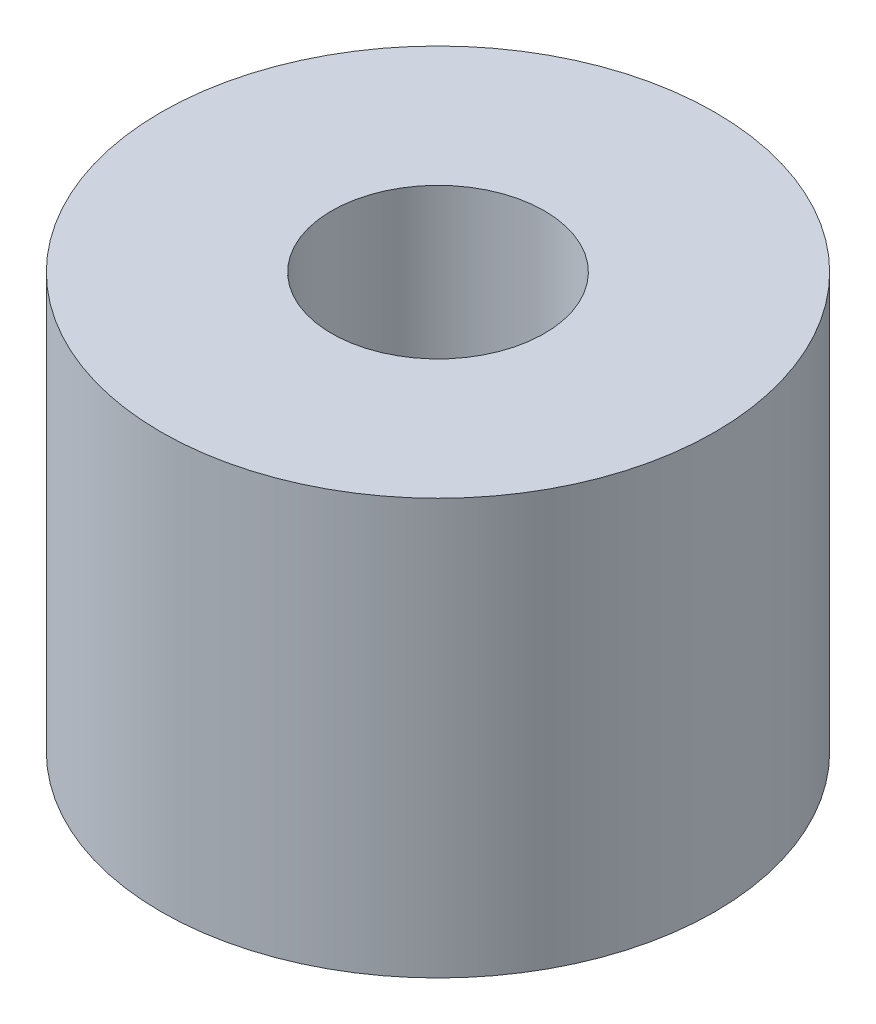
ISO-10303-21;
HEADER;
FILE_DESCRIPTION(('STEP AP214'),'2;1');
FILE_NAME('part.step','',(''),(''),'','','');
FILE_SCHEMA(('AUTOMOTIVE_DESIGN { 1 0 10303 214 1 1 1 1 }'));
ENDSEC;
DATA;
#1=APPLICATION_CONTEXT('core data for automotive mechanical design processes');
#2=APPLICATION_PROTOCOL_DEFINITION('international standard','automotive_design',2000,#1);
#3=PRODUCT_CONTEXT('',#1,'mechanical');
#4=PRODUCT('Part','Part','',(#3));
#5=PRODUCT_RELATED_PRODUCT_CATEGORY('part','',(#4));
#6=PRODUCT_DEFINITION_FORMATION('','',#4);
#7=PRODUCT_DEFINITION_CONTEXT('part definition',#1,'design');
#8=PRODUCT_DEFINITION('design','',#6,#7);
#9=PRODUCT_DEFINITION_SHAPE('','',#8);
#10=(LENGTH_UNIT() NAMED_UNIT(*) SI_UNIT(.MILLI.,.METRE.));
#11=(NAMED_UNIT(*) PLANE_ANGLE_UNIT() SI_UNIT($,.RADIAN.));
#12=(NAMED_UNIT(*) SI_UNIT($,.STERADIAN.) SOLID_ANGLE_UNIT());
#13=UNCERTAINTY_MEASURE_WITH_UNIT(LENGTH_MEASURE(1.E-05),#10,'distance_accuracy_value','');
#14=(GEOMETRIC_REPRESENTATION_CONTEXT(3) GLOBAL_UNCERTAINTY_ASSIGNED_CONTEXT((#13)) GLOBAL_UNIT_ASSIGNED_CONTEXT((#10,
#11,#12)) REPRESENTATION_CONTEXT('',''));
#15=CARTESIAN_POINT('',(0.,0.,0.));
#16=DIRECTION('',(0.,0.,1.));
#17=DIRECTION('',(1.,0.,0.));
#18=AXIS2_PLACEMENT_3D('',#15,#16,#17);
#19=CARTESIAN_POINT('',(0.,9.525,0.));
#20=DIRECTION('',(0.,1.,0.));
#21=DIRECTION('',(0.,0.,1.));
#22=AXIS2_PLACEMENT_3D('',#19,#20,#21);
#23=PLANE('',#22);
#24=CARTESIAN_POINT('',(0.,9.525,0.));
#25=DIRECTION('',(0.,1.,0.));
#26=DIRECTION('',(0.,0.,1.));
#27=AXIS2_PLACEMENT_3D('',#24,#25,#26);
#28=CIRCLE('',#27,6.35);
#29=CARTESIAN_POINT('',(0.,9.525,-6.35));
#30=VERTEX_POINT('',#29);
#31=EDGE_CURVE('E10',#30,#30,#28,.T.);
#32=ORIENTED_EDGE('',*,*,#31,.T.);
#33=EDGE_LOOP('',(#32));
#34=FACE_BOUND('',#33,.T.);
#35=CARTESIAN_POINT('',(0.,9.525,0.));
#36=DIRECTION('',(0.,1.,0.));
#37=DIRECTION('',(0.,0.,1.));
#38=AXIS2_PLACEMENT_3D('',#35,#36,#37);
#39=CIRCLE('',#38,2.4384);
#40=CARTESIAN_POINT('',(0.,9.525,-2.4384));
#41=VERTEX_POINT('',#40);
#42=EDGE_CURVE('E44',#41,#41,#39,.T.);
#43=ORIENTED_EDGE('',*,*,#42,.F.);
#44=EDGE_LOOP('',(#43));
#45=FACE_BOUND('',#44,.T.);
#46=ADVANCED_FACE('F33',(#34,#45),#23,.T.);
#47=CARTESIAN_POINT('',(0.,0.,0.));
#48=DIRECTION('',(0.,1.,0.));
#49=DIRECTION('',(0.,0.,1.));
#50=AXIS2_PLACEMENT_3D('',#47,#48,#49);
#51=PLANE('',#50);
#52=CARTESIAN_POINT('',(0.,0.,0.));
#53=DIRECTION('',(0.,1.,0.));
#54=DIRECTION('',(0.,0.,1.));
#55=AXIS2_PLACEMENT_3D('',#52,#53,#54);
#56=CIRCLE('',#55,6.35);
#57=CARTESIAN_POINT('',(0.,0.,-6.35));
#58=VERTEX_POINT('',#57);
#59=EDGE_CURVE('E37',#58,#58,#56,.T.);
#60=ORIENTED_EDGE('',*,*,#59,.F.);
#61=EDGE_LOOP('',(#60));
#62=FACE_BOUND('',#61,.T.);
#63=CARTESIAN_POINT('',(0.,0.,0.));
#64=DIRECTION('',(0.,1.,0.));
#65=DIRECTION('',(0.,0.,1.));
#66=AXIS2_PLACEMENT_3D('',#63,#64,#65);
#67=CIRCLE('',#66,2.4384);
#68=CARTESIAN_POINT('',(0.,0.,-2.4384));
#69=VERTEX_POINT('',#68);
#70=EDGE_CURVE('E46',#69,#69,#67,.T.);
#71=ORIENTED_EDGE('',*,*,#70,.T.);
#72=EDGE_LOOP('',(#71));
#73=FACE_BOUND('',#72,.T.);
#74=ADVANCED_FACE('F56',(#62,#73),#51,.F.);
#75=CARTESIAN_POINT('',(0.,9.525,0.));
#76=DIRECTION('',(0.,-1.,0.));
#77=DIRECTION('',(0.,0.,-1.));
#78=AXIS2_PLACEMENT_3D('',#75,#76,#77);
#79=CYLINDRICAL_SURFACE('',#78,6.35);
#80=CARTESIAN_POINT('',(0.,9.525,-6.35));
#81=CARTESIAN_POINT('',(0.,9.42578125,-6.35));
#82=CARTESIAN_POINT('',(0.,9.3265625,-6.35));
#83=CARTESIAN_POINT('',(0.,9.128125,-6.35));
#84=CARTESIAN_POINT('',(0.,9.02890625,-6.35));
#85=CARTESIAN_POINT('',(0.,8.83046875,-6.35));
#86=CARTESIAN_POINT('',(0.,8.73125,-6.35));
#87=CARTESIAN_POINT('',(0.,8.5328125,-6.35));
#88=CARTESIAN_POINT('',(0.,8.43359375,-6.35));
#89=CARTESIAN_POINT('',(0.,8.23515625,-6.35));
#90=CARTESIAN_POINT('',(0.,8.1359375,-6.35));
#91=CARTESIAN_POINT('',(0.,7.9375,-6.35));
#92=CARTESIAN_POINT('',(0.,7.83828125,-6.35));
#93=CARTESIAN_POINT('',(0.,7.63984375,-6.35));
#94=CARTESIAN_POINT('',(0.,7.540625,-6.35));
#95=CARTESIAN_POINT('',(0.,7.3421875,-6.35));
#96=CARTESIAN_POINT('',(0.,7.24296875,-6.35));
#97=CARTESIAN_POINT('',(0.,7.04453125,-6.35));
#98=CARTESIAN_POINT('',(0.,6.9453125,-6.35));
#99=CARTESIAN_POINT('',(0.,6.746875,-6.35));
#100=CARTESIAN_POINT('',(0.,6.64765625,-6.35));
#101=CARTESIAN_POINT('',(0.,6.44921875,-6.35));
#102=CARTESIAN_POINT('',(0.,6.35,-6.35));
#103=CARTESIAN_POINT('',(0.,6.1515625,-6.35));
#104=CARTESIAN_POINT('',(0.,6.05234375,-6.35));
#105=CARTESIAN_POINT('',(0.,5.85390625,-6.35));
#106=CARTESIAN_POINT('',(0.,5.7546875,-6.35));
#107=CARTESIAN_POINT('',(0.,5.55625,-6.35));
#108=CARTESIAN_POINT('',(0.,5.45703125,-6.35));
#109=CARTESIAN_POINT('',(0.,5.25859375,-6.35));
#110=CARTESIAN_POINT('',(0.,5.159375,-6.35));
#111=CARTESIAN_POINT('',(0.,4.9609375,-6.35));
#112=CARTESIAN_POINT('',(0.,4.86171875,-6.35));
#113=CARTESIAN_POINT('',(0.,4.66328125,-6.35));
#114=CARTESIAN_POINT('',(0.,4.5640625,-6.35));
#115=CARTESIAN_POINT('',(0.,4.365625,-6.35));
#116=CARTESIAN_POINT('',(0.,4.26640625,-6.35));
#117=CARTESIAN_POINT('',(0.,4.06796875,-6.35));
#118=CARTESIAN_POINT('',(0.,3.96875,-6.35));
#119=CARTESIAN_POINT('',(0.,3.7703125,-6.35));
#120=CARTESIAN_POINT('',(0.,3.67109375,-6.35));
#121=CARTESIAN_POINT('',(0.,3.47265625,-6.35));
#122=CARTESIAN_POINT('',(0.,3.3734375,-6.35));
#123=CARTESIAN_POINT('',(0.,3.175,-6.35));
#124=CARTESIAN_POINT('',(0.,3.07578125,-6.35));
#125=CARTESIAN_POINT('',(0.,2.87734375,-6.35));
#126=CARTESIAN_POINT('',(0.,2.778125,-6.35));
#127=CARTESIAN_POINT('',(0.,2.5796875,-6.35));
#128=CARTESIAN_POINT('',(0.,2.48046875,-6.35));
#129=CARTESIAN_POINT('',(0.,2.28203125,-6.35));
#130=CARTESIAN_POINT('',(0.,2.1828125,-6.35));
#131=CARTESIAN_POINT('',(0.,1.984375,-6.35));
#132=CARTESIAN_POINT('',(0.,1.88515625,-6.35));
#133=CARTESIAN_POINT('',(0.,1.68671875,-6.35));
#134=CARTESIAN_POINT('',(0.,1.5875,-6.35));
#135=CARTESIAN_POINT('',(0.,1.3890625,-6.35));
#136=CARTESIAN_POINT('',(0.,1.28984375,-6.35));
#137=CARTESIAN_POINT('',(0.,1.09140625,-6.35));
#138=CARTESIAN_POINT('',(0.,0.992187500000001,-6.35));
#139=CARTESIAN_POINT('',(0.,0.793750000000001,-6.35));
#140=CARTESIAN_POINT('',(0.,0.69453125,-6.35));
#141=CARTESIAN_POINT('',(0.,0.49609375,-6.35));
#142=CARTESIAN_POINT('',(0.,0.396875,-6.35));
#143=CARTESIAN_POINT('',(0.,0.1984375,-6.35));
#144=CARTESIAN_POINT('',(0.,0.0992187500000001,-6.35));
#145=CARTESIAN_POINT('',(0.,0.,-6.35));
#146=B_SPLINE_CURVE_WITH_KNOTS('',3,(#80,#81,#82,#83,#84,#85,#86,#87,#88,#89,#90,#91,#92,#93,
#94,#95,#96,#97,#98,#99,#100,#101,#102,#103,#104,#105,#106,#107,#108,#109,#110,#111,#112,#113,
#114,#115,#116,#117,#118,#119,#120,#121,#122,#123,#124,#125,#126,#127,#128,#129,#130,#131,#132,
#133,#134,#135,#136,#137,#138,#139,#140,#141,#142,#143,#144,#145),.UNSPECIFIED.,.F.,.F.,(4,2,2,
2,2,2,2,2,2,2,2,2,2,2,2,2,2,2,2,2,2,2,2,2,2,2,2,2,2,2,2,2,4),(0.,0.297656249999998,
0.595312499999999,0.892968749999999,1.190625,1.48828125,1.7859375,2.08359375,2.38125,2.67890625,
2.9765625,3.27421875,3.571875,3.86953125,4.1671875,4.46484375,4.7625,5.06015625,5.3578125,
5.65546875,5.953125,6.25078125,6.5484375,6.84609375,7.14375,7.44140625,7.7390625,8.03671875,
8.334375,8.63203125,8.9296875,9.22734375,9.525),.UNSPECIFIED.);
#147=EDGE_CURVE('BSEAM35',#30,#58,#146,.T.);
#148=ORIENTED_EDGE('',*,*,#31,.F.);
#149=ORIENTED_EDGE('',*,*,#59,.T.);
#150=ORIENTED_EDGE('',*,*,#147,.T.);
#151=ORIENTED_EDGE('',*,*,#147,.F.);
#152=EDGE_LOOP('',(#148,#150,#149,#151));
#153=FACE_BOUND('',#152,.T.);
#154=ADVANCED_FACE('F35',(#153),#79,.T.);
#155=CARTESIAN_POINT('',(0.,9.525,0.));
#156=DIRECTION('',(0.,-1.,0.));
#157=DIRECTION('',(0.,0.,-1.));
#158=AXIS2_PLACEMENT_3D('',#155,#156,#157);
#159=CYLINDRICAL_SURFACE('',#158,2.4384);
#160=CARTESIAN_POINT('',(0.,9.525,-2.4384));
#161=CARTESIAN_POINT('',(0.,9.42578125,-2.4384));
#162=CARTESIAN_POINT('',(0.,9.3265625,-2.4384));
#163=CARTESIAN_POINT('',(0.,9.128125,-2.4384));
#164=CARTESIAN_POINT('',(0.,9.02890625,-2.4384));
#165=CARTESIAN_POINT('',(0.,8.83046875,-2.4384));
#166=CARTESIAN_POINT('',(0.,8.73125,-2.4384));
#167=CARTESIAN_POINT('',(0.,8.5328125,-2.4384));
#168=CARTESIAN_POINT('',(0.,8.43359375,-2.4384));
#169=CARTESIAN_POINT('',(0.,8.23515625,-2.4384));
#170=CARTESIAN_POINT('',(0.,8.1359375,-2.4384));
#171=CARTESIAN_POINT('',(0.,7.9375,-2.4384));
#172=CARTESIAN_POINT('',(0.,7.83828125,-2.4384));
#173=CARTESIAN_POINT('',(0.,7.63984375,-2.4384));
#174=CARTESIAN_POINT('',(0.,7.540625,-2.4384));
#175=CARTESIAN_POINT('',(0.,7.3421875,-2.4384));
#176=CARTESIAN_POINT('',(0.,7.24296875,-2.4384));
#177=CARTESIAN_POINT('',(0.,7.04453125,-2.4384));
#178=CARTESIAN_POINT('',(0.,6.9453125,-2.4384));
#179=CARTESIAN_POINT('',(0.,6.746875,-2.4384));
#180=CARTESIAN_POINT('',(0.,6.64765625,-2.4384));
#181=CARTESIAN_POINT('',(0.,6.44921875,-2.4384));
#182=CARTESIAN_POINT('',(0.,6.35,-2.4384));
#183=CARTESIAN_POINT('',(0.,6.1515625,-2.4384));
#184=CARTESIAN_POINT('',(0.,6.05234375,-2.4384));
#185=CARTESIAN_POINT('',(0.,5.85390625,-2.4384));
#186=CARTESIAN_POINT('',(0.,5.7546875,-2.4384));
#187=CARTESIAN_POINT('',(0.,5.55625,-2.4384));
#188=CARTESIAN_POINT('',(0.,5.45703125,-2.4384));
#189=CARTESIAN_POINT('',(0.,5.25859375,-2.4384));
#190=CARTESIAN_POINT('',(0.,5.159375,-2.4384));
#191=CARTESIAN_POINT('',(0.,4.9609375,-2.4384));
#192=CARTESIAN_POINT('',(0.,4.86171875,-2.4384));
#193=CARTESIAN_POINT('',(0.,4.66328125,-2.4384));
#194=CARTESIAN_POINT('',(0.,4.5640625,-2.4384));
#195=CARTESIAN_POINT('',(0.,4.365625,-2.4384));
#196=CARTESIAN_POINT('',(0.,4.26640625,-2.4384));
#197=CARTESIAN_POINT('',(0.,4.06796875,-2.4384));
#198=CARTESIAN_POINT('',(0.,3.96875,-2.4384));
#199=CARTESIAN_POINT('',(0.,3.7703125,-2.4384));
#200=CARTESIAN_POINT('',(0.,3.67109375,-2.4384));
#201=CARTESIAN_POINT('',(0.,3.47265625,-2.4384));
#202=CARTESIAN_POINT('',(0.,3.3734375,-2.4384));
#203=CARTESIAN_POINT('',(0.,3.175,-2.4384));
#204=CARTESIAN_POINT('',(0.,3.07578125,-2.4384));
#205=CARTESIAN_POINT('',(0.,2.87734375,-2.4384));
#206=CARTESIAN_POINT('',(0.,2.778125,-2.4384));
#207=CARTESIAN_POINT('',(0.,2.5796875,-2.4384));
#208=CARTESIAN_POINT('',(0.,2.48046875,-2.4384));
#209=CARTESIAN_POINT('',(0.,2.28203125,-2.4384));
#210=CARTESIAN_POINT('',(0.,2.1828125,-2.4384));
#211=CARTESIAN_POINT('',(0.,1.984375,-2.4384));
#212=CARTESIAN_POINT('',(0.,1.88515625,-2.4384));
#213=CARTESIAN_POINT('',(0.,1.68671875,-2.4384));
#214=CARTESIAN_POINT('',(0.,1.5875,-2.4384));
#215=CARTESIAN_POINT('',(0.,1.3890625,-2.4384));
#216=CARTESIAN_POINT('',(0.,1.28984375,-2.4384));
#217=CARTESIAN_POINT('',(0.,1.09140625,-2.4384));
#218=CARTESIAN_POINT('',(0.,0.992187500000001,-2.4384));
#219=CARTESIAN_POINT('',(0.,0.793750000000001,-2.4384));
#220=CARTESIAN_POINT('',(0.,0.69453125,-2.4384));
#221=CARTESIAN_POINT('',(0.,0.49609375,-2.4384));
#222=CARTESIAN_POINT('',(0.,0.396875,-2.4384));
#223=CARTESIAN_POINT('',(0.,0.1984375,-2.4384));
#224=CARTESIAN_POINT('',(0.,0.0992187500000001,-2.4384));
#225=CARTESIAN_POINT('',(0.,0.,-2.4384));
#226=B_SPLINE_CURVE_WITH_KNOTS('',3,(#160,#161,#162,#163,#164,#165,#166,#167,#168,#169,#170,
#171,#172,#173,#174,#175,#176,#177,#178,#179,#180,#181,#182,#183,#184,#185,#186,#187,#188,#189,
#190,#191,#192,#193,#194,#195,#196,#197,#198,#199,#200,#201,#202,#203,#204,#205,#206,#207,#208,
#209,#210,#211,#212,#213,#214,#215,#216,#217,#218,#219,#220,#221,#222,#223,#224,#225),
.UNSPECIFIED.,.F.,.F.,(4,2,2,2,2,2,2,2,2,2,2,2,2,2,2,2,2,2,2,2,2,2,2,2,2,2,2,2,2,2,2,2,4),(0.,
0.29765625,0.5953125,0.892968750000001,1.190625,1.48828125,1.7859375,2.08359375,2.38125,
2.67890625,2.9765625,3.27421875,3.571875,3.86953125,4.1671875,4.46484375,4.7625,5.06015625,
5.3578125,5.65546875,5.953125,6.25078125,6.5484375,6.84609375,7.14375,7.44140625,7.7390625,
8.03671875,8.334375,8.63203125,8.9296875,9.22734375,9.525),.UNSPECIFIED.);
#227=EDGE_CURVE('BSEAM52',#41,#69,#226,.T.);
#228=ORIENTED_EDGE('',*,*,#42,.T.);
#229=ORIENTED_EDGE('',*,*,#70,.F.);
#230=ORIENTED_EDGE('',*,*,#227,.T.);
#231=ORIENTED_EDGE('',*,*,#227,.F.);
#232=EDGE_LOOP('',(#228,#230,#229,#231));
#233=FACE_BOUND('',#232,.T.);
#234=ADVANCED_FACE('F52',(#233),#159,.F.);
#235=CLOSED_SHELL('',(#46,#74,#154,#234));
#236=MANIFOLD_SOLID_BREP('B2',#235);
#237=ADVANCED_BREP_SHAPE_REPRESENTATION('',(#18,#236),#14);
#238=SHAPE_DEFINITION_REPRESENTATION(#9,#237);
ENDSEC;
END-ISO-10303-21;
